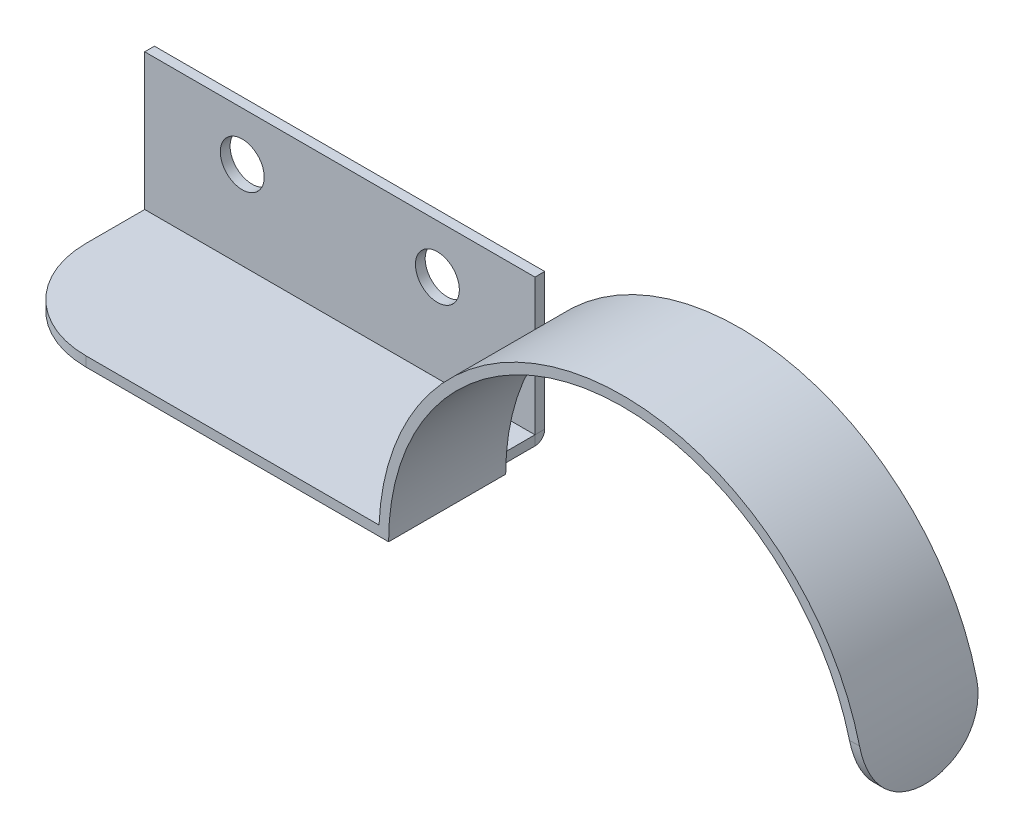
ISO-10303-21;
HEADER;
FILE_DESCRIPTION(('STEP AP214'),'2;1');
FILE_NAME('part.step','',(''),(''),'','','');
FILE_SCHEMA(('AUTOMOTIVE_DESIGN { 1 0 10303 214 1 1 1 1 }'));
ENDSEC;
DATA;
#1=APPLICATION_CONTEXT('core data for automotive mechanical design processes');
#2=APPLICATION_PROTOCOL_DEFINITION('international standard','automotive_design',2000,#1);
#3=PRODUCT_CONTEXT('',#1,'mechanical');
#4=PRODUCT('Part','Part','',(#3));
#5=PRODUCT_RELATED_PRODUCT_CATEGORY('part','',(#4));
#6=PRODUCT_DEFINITION_FORMATION('','',#4);
#7=PRODUCT_DEFINITION_CONTEXT('part definition',#1,'design');
#8=PRODUCT_DEFINITION('design','',#6,#7);
#9=PRODUCT_DEFINITION_SHAPE('','',#8);
#10=(LENGTH_UNIT() NAMED_UNIT(*) SI_UNIT(.MILLI.,.METRE.));
#11=(NAMED_UNIT(*) PLANE_ANGLE_UNIT() SI_UNIT($,.RADIAN.));
#12=(NAMED_UNIT(*) SI_UNIT($,.STERADIAN.) SOLID_ANGLE_UNIT());
#13=UNCERTAINTY_MEASURE_WITH_UNIT(LENGTH_MEASURE(1.E-05),#10,'distance_accuracy_value','');
#14=(GEOMETRIC_REPRESENTATION_CONTEXT(3) GLOBAL_UNCERTAINTY_ASSIGNED_CONTEXT((#13)) GLOBAL_UNIT_ASSIGNED_CONTEXT((#10,
#11,#12)) REPRESENTATION_CONTEXT('',''));
#15=CARTESIAN_POINT('',(0.,0.,0.));
#16=DIRECTION('',(0.,0.,1.));
#17=DIRECTION('',(1.,0.,0.));
#18=AXIS2_PLACEMENT_3D('',#15,#16,#17);
#19=CARTESIAN_POINT('',(65.,14.9999000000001,4.99992721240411));
#20=DIRECTION('',(0.,0.,1.));
#21=DIRECTION('',(1.,0.,0.));
#22=AXIS2_PLACEMENT_3D('',#19,#20,#21);
#23=CYLINDRICAL_SURFACE('',#22,25.);
#24=CARTESIAN_POINT('',(89.2693221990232,20.9999000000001,16.9999272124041));
#25=CARTESIAN_POINT('',(89.3097277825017,20.836531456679,16.9999462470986));
#26=CARTESIAN_POINT('',(89.3484559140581,20.6727348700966,16.9932552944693));
#27=CARTESIAN_POINT('',(89.4223916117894,20.3454330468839,16.9663816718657));
#28=CARTESIAN_POINT('',(89.4575987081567,20.1819278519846,16.946197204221));
#29=CARTESIAN_POINT('',(89.5243068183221,19.8564443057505,16.8922720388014));
#30=CARTESIAN_POINT('',(89.5558088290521,19.6944655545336,16.8585349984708));
#31=CARTESIAN_POINT('',(89.615051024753,19.3732196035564,16.7775861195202));
#32=CARTESIAN_POINT('',(89.6427914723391,19.2139522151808,16.7303752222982));
#33=CARTESIAN_POINT('',(89.6945610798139,18.899148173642,16.6226094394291));
#34=CARTESIAN_POINT('',(89.7185855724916,18.7436164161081,16.5620380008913));
#35=CARTESIAN_POINT('',(89.7629915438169,18.4376546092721,16.4278927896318));
#36=CARTESIAN_POINT('',(89.7833716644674,18.2872264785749,16.3543141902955));
#37=CARTESIAN_POINT('',(89.8206410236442,17.9928541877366,16.1947018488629));
#38=CARTESIAN_POINT('',(89.8375333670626,17.8489043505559,16.1086793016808));
#39=CARTESIAN_POINT('',(89.8681034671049,17.5684289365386,15.9246756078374));
#40=CARTESIAN_POINT('',(89.8817801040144,17.4319059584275,15.8266903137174));
#41=CARTESIAN_POINT('',(89.906031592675,17.1693949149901,15.621032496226));
#42=CARTESIAN_POINT('',(89.9166500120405,17.0432792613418,15.5135278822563));
#43=CARTESIAN_POINT('',(89.935386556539,16.8002754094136,15.2883525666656));
#44=CARTESIAN_POINT('',(89.9435046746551,16.6833872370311,15.1706818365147));
#45=CARTESIAN_POINT('',(89.957599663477,16.4596254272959,14.9259199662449));
#46=CARTESIAN_POINT('',(89.9635751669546,16.3527582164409,14.7988228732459));
#47=CARTESIAN_POINT('',(89.973741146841,16.1499279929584,14.5362090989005));
#48=CARTESIAN_POINT('',(89.9779322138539,16.0539613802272,14.4006952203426));
#49=CARTESIAN_POINT('',(89.98491564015,15.8729698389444,14.1212229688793));
#50=CARTESIAN_POINT('',(89.9876984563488,15.7880223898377,13.9772141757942));
#51=CARTESIAN_POINT('',(89.9921708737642,15.6304607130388,13.6826519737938));
#52=CARTESIAN_POINT('',(89.9938608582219,15.5578421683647,13.5321008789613));
#53=CARTESIAN_POINT('',(89.9964654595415,15.425459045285,13.2255633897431));
#54=CARTESIAN_POINT('',(89.9973806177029,15.3656855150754,13.0695808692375));
#55=CARTESIAN_POINT('',(89.9987099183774,15.2593593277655,12.7532233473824));
#56=CARTESIAN_POINT('',(89.9991241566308,15.212804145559,12.5928491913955));
#57=CARTESIAN_POINT('',(89.9997995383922,15.1156006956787,12.1969810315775));
#58=CARTESIAN_POINT('',(89.9999117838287,15.0722601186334,11.9596543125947));
#59=CARTESIAN_POINT('',(90.0000127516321,15.0144109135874,11.4815044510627));
#60=CARTESIAN_POINT('',(90.0000014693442,14.9999033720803,11.2406811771));
#61=CARTESIAN_POINT('',(89.9999989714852,14.9998976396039,10.8314037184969));
#62=CARTESIAN_POINT('',(90.0000027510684,15.0070019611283,10.6629141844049));
#63=CARTESIAN_POINT('',(89.9999791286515,15.035366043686,10.3270788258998));
#64=CARTESIAN_POINT('',(89.9999517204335,15.0566286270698,10.1597332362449));
#65=CARTESIAN_POINT('',(89.9997592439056,15.1131815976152,9.82732663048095));
#66=CARTESIAN_POINT('',(89.9995940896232,15.1484807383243,9.66226710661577));
#67=CARTESIAN_POINT('',(89.9989500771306,15.232870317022,9.33564725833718));
#68=CARTESIAN_POINT('',(89.998471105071,15.2819657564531,9.17408822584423));
#69=CARTESIAN_POINT('',(89.9969626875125,15.3935560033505,8.85578857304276));
#70=CARTESIAN_POINT('',(89.995933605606,15.4560419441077,8.69904484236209));
#71=CARTESIAN_POINT('',(89.993034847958,15.5940118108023,8.39132313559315));
#72=CARTESIAN_POINT('',(89.9911648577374,15.6695005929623,8.24034733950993));
#73=CARTESIAN_POINT('',(89.9862528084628,15.8328716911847,7.94538536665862));
#74=CARTESIAN_POINT('',(89.9832113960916,15.9207471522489,7.80139538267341));
#75=CARTESIAN_POINT('',(89.9755920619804,16.1083278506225,7.52128576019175));
#76=CARTESIAN_POINT('',(89.9710134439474,16.2080384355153,7.38516972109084));
#77=CARTESIAN_POINT('',(89.9599531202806,16.4182759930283,7.12217054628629));
#78=CARTESIAN_POINT('',(89.9534759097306,16.5287770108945,6.99526647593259));
#79=CARTESIAN_POINT('',(89.9382387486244,16.7599146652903,6.75131031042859));
#80=CARTESIAN_POINT('',(89.9294798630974,16.8805465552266,6.63425365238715));
#81=CARTESIAN_POINT('',(89.9093101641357,17.1311119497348,6.41073642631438));
#82=CARTESIAN_POINT('',(89.8978986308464,17.2610479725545,6.30427874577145));
#83=CARTESIAN_POINT('',(89.8720940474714,17.5291412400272,6.10279129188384));
#84=CARTESIAN_POINT('',(89.8577021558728,17.6672952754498,6.00775710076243));
#85=CARTESIAN_POINT('',(89.8257949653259,17.9494536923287,5.83056879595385));
#86=CARTESIAN_POINT('',(89.8083104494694,18.0933904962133,5.74830151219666));
#87=CARTESIAN_POINT('',(89.7699100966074,18.3871538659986,5.59614033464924));
#88=CARTESIAN_POINT('',(89.7489955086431,18.536978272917,5.52624195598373));
#89=CARTESIAN_POINT('',(89.7035674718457,18.841440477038,5.3991898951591));
#90=CARTESIAN_POINT('',(89.6790535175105,18.9960789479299,5.34203800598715));
#91=CARTESIAN_POINT('',(89.6263619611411,19.3089004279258,5.24079839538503));
#92=CARTESIAN_POINT('',(89.5981850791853,19.4670827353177,5.19670811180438));
#93=CARTESIAN_POINT('',(89.5255158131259,19.8529407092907,5.10598913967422));
#94=CARTESIAN_POINT('',(89.4791420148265,20.081894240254,5.06607510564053));
#95=CARTESIAN_POINT('',(89.4043040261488,20.4261120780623,5.0263083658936));
#96=CARTESIAN_POINT('',(89.3784977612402,20.5409045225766,5.0164034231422));
#97=CARTESIAN_POINT('',(89.3251762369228,20.7704886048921,5.00321327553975));
#98=CARTESIAN_POINT('',(89.2976607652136,20.8852802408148,4.99992889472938));
#99=CARTESIAN_POINT('',(89.2693221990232,20.9999000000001,4.99992721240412));
#100=B_SPLINE_CURVE_WITH_KNOTS('',3,(#24,#25,#26,#27,#28,#29,#30,#31,#32,#33,#34,#35,#36,#37,
#38,#39,#40,#41,#42,#43,#44,#45,#46,#47,#48,#49,#50,#51,#52,#53,#54,#55,#56,#57,#58,#59,#60,#61,
#62,#63,#64,#65,#66,#67,#68,#69,#70,#71,#72,#73,#74,#75,#76,#77,#78,#79,#80,#81,#82,#83,#84,#85,
#86,#87,#88,#89,#90,#91,#92,#93,#94,#95,#96,#97,#98,#99),.UNSPECIFIED.,.F.,.F.,(4,2,2,2,2,2,2,2,
2,2,2,2,2,2,2,2,2,2,2,2,2,2,2,2,2,2,2,2,2,2,2,2,2,2,2,2,2,4),(0.,0.504750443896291,
1.00956814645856,1.51424970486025,2.01889601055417,2.5241710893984,3.02963405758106,
3.53464509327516,4.03983171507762,4.53741836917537,5.03500641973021,5.5329114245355,
6.03065150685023,6.53172083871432,7.03261435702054,7.53315765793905,8.03360527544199,
8.75554256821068,9.47750706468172,9.98286937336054,10.4883324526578,10.9941112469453,
11.5000736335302,12.0057020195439,12.5115196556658,13.0170584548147,13.5228265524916,
14.0274067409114,14.5317518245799,15.0362339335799,15.5405203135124,16.0400439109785,
16.5393860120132,17.0387983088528,17.5381125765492,18.2471859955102,18.6012429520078,
18.9553439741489),.UNSPECIFIED.);
#101=CARTESIAN_POINT('',(89.2693221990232,20.9999000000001,16.9999272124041));
#102=VERTEX_POINT('',#101);
#103=CARTESIAN_POINT('',(89.2693221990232,20.9999000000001,4.99992721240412));
#104=VERTEX_POINT('',#103);
#105=EDGE_CURVE('E171',#102,#104,#100,.T.);
#106=ORIENTED_EDGE('',*,*,#105,.T.);
#107=CARTESIAN_POINT('',(65.,14.9999000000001,4.99992721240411));
#108=DIRECTION('',(0.,0.,1.));
#109=DIRECTION('',(1.,0.,0.));
#110=AXIS2_PLACEMENT_3D('',#107,#108,#109);
#111=CIRCLE('',#110,25.);
#112=CARTESIAN_POINT('',(40.0200080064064,15.9999000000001,4.99992721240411));
#113=VERTEX_POINT('',#112);
#114=EDGE_CURVE('E155',#104,#113,#111,.T.);
#115=ORIENTED_EDGE('',*,*,#114,.T.);
#116=DIRECTION('',(0.,0.,1.));
#117=VECTOR('',#116,1.);
#118=CARTESIAN_POINT('',(40.0200080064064,15.9999000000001,4.99992721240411));
#119=LINE('',#118,#117);
#120=CARTESIAN_POINT('',(40.0200080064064,15.9999000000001,16.9999272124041));
#121=VERTEX_POINT('',#120);
#122=EDGE_CURVE('E173',#113,#121,#119,.T.);
#123=ORIENTED_EDGE('',*,*,#122,.T.);
#124=CARTESIAN_POINT('',(65.,14.9999000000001,16.9999272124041));
#125=DIRECTION('',(0.,0.,1.));
#126=DIRECTION('',(1.,0.,0.));
#127=AXIS2_PLACEMENT_3D('',#124,#125,#126);
#128=CIRCLE('',#127,25.);
#129=EDGE_CURVE('E170',#102,#121,#128,.T.);
#130=ORIENTED_EDGE('',*,*,#129,.F.);
#131=EDGE_LOOP('',(#106,#115,#123,#130));
#132=FACE_BOUND('',#131,.T.);
#133=ADVANCED_FACE('F48',(#132),#23,.T.);
#134=CARTESIAN_POINT('',(65.,14.9999000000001,4.99992721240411));
#135=DIRECTION('',(0.,0.,1.));
#136=DIRECTION('',(1.,0.,0.));
#137=AXIS2_PLACEMENT_3D('',#134,#135,#136);
#138=CYLINDRICAL_SURFACE('',#137,24.);
#139=CARTESIAN_POINT('',(65.,14.9999000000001,4.99992721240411));
#140=DIRECTION('',(0.,0.,-1.));
#141=DIRECTION('',(1.,0.,0.));
#142=AXIS2_PLACEMENT_3D('',#139,#140,#141);
#143=CIRCLE('',#142,24.);
#144=CARTESIAN_POINT('',(41.,14.9999000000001,4.99992721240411));
#145=VERTEX_POINT('',#144);
#146=CARTESIAN_POINT('',(88.2379000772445,20.9999000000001,4.99992721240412));
#147=VERTEX_POINT('',#146);
#148=EDGE_CURVE('E152',#145,#147,#143,.T.);
#149=ORIENTED_EDGE('',*,*,#148,.T.);
#150=CARTESIAN_POINT('',(88.2379000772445,20.9999000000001,4.99992721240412));
#151=CARTESIAN_POINT('',(88.2799795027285,20.8369941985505,4.99990813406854));
#152=CARTESIAN_POINT('',(88.3203173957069,20.6736241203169,5.00656141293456));
#153=CARTESIAN_POINT('',(88.3973374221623,20.3470981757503,5.03330108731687));
#154=CARTESIAN_POINT('',(88.4340190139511,20.1839423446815,5.05338946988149));
#155=CARTESIAN_POINT('',(88.5035331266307,19.8590742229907,5.10708158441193));
#156=CARTESIAN_POINT('',(88.5363665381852,19.6973616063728,5.14068218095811));
#157=CARTESIAN_POINT('',(88.5981223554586,19.3765750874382,5.2213320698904));
#158=CARTESIAN_POINT('',(88.6270450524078,19.2175009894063,5.26838036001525));
#159=CARTESIAN_POINT('',(88.6810319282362,18.9030041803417,5.37581152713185));
#160=CARTESIAN_POINT('',(88.7060909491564,18.7475865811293,5.43621197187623));
#161=CARTESIAN_POINT('',(88.7524163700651,18.4417949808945,5.57001364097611));
#162=CARTESIAN_POINT('',(88.7736813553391,18.2914228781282,5.64341969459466));
#163=CARTESIAN_POINT('',(88.8125776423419,17.997093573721,5.80270362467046));
#164=CARTESIAN_POINT('',(88.8302116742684,17.8531316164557,5.88857204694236));
#165=CARTESIAN_POINT('',(88.862123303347,17.5726415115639,6.07225001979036));
#166=CARTESIAN_POINT('',(88.8764008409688,17.4361134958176,6.17005978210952));
#167=CARTESIAN_POINT('',(88.9017090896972,17.1736990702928,6.37526699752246));
#168=CARTESIAN_POINT('',(88.912788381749,17.0476767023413,6.48248469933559));
#169=CARTESIAN_POINT('',(88.9323448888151,16.8048135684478,6.7070721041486));
#170=CARTESIAN_POINT('',(88.9408221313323,16.6879727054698,6.82444169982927));
#171=CARTESIAN_POINT('',(88.9555458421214,16.4642763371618,7.06857350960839));
#172=CARTESIAN_POINT('',(88.9617912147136,16.357425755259,7.19534030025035));
#173=CARTESIAN_POINT('',(88.9724239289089,16.1545483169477,7.45732696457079));
#174=CARTESIAN_POINT('',(88.9768112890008,16.0585213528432,7.5925467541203));
#175=CARTESIAN_POINT('',(88.9841275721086,15.8773426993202,7.8714684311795));
#176=CARTESIAN_POINT('',(88.987046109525,15.7922715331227,8.01522290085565));
#177=CARTESIAN_POINT('',(88.9917403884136,15.6344293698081,8.30928347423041));
#178=CARTESIAN_POINT('',(88.9935165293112,15.5616540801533,8.45958726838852));
#179=CARTESIAN_POINT('',(88.9962569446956,15.4289243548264,8.76564250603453));
#180=CARTESIAN_POINT('',(88.9972217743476,15.3689611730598,8.92139014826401));
#181=CARTESIAN_POINT('',(88.9986254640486,15.2622245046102,9.2372914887));
#182=CARTESIAN_POINT('',(88.9990644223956,15.2154485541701,9.39744435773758));
#183=CARTESIAN_POINT('',(88.9997853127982,15.1172149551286,9.79463024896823));
#184=CARTESIAN_POINT('',(88.9999055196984,15.073270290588,10.0335618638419));
#185=CARTESIAN_POINT('',(89.000013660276,15.0146139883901,10.5149952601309));
#186=CARTESIAN_POINT('',(89.0000015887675,14.9999034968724,10.7574971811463));
#187=CARTESIAN_POINT('',(88.9999988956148,14.9998975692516,11.1684453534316));
#188=CARTESIAN_POINT('',(89.000002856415,15.0070014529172,11.3369287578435));
#189=CARTESIAN_POINT('',(88.9999782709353,15.0353635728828,11.6727518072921));
#190=CARTESIAN_POINT('',(88.9999497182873,15.056624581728,11.8400912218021));
#191=CARTESIAN_POINT('',(88.9997492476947,15.1131729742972,12.1724833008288));
#192=CARTESIAN_POINT('',(88.9995772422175,15.148468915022,12.3375345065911));
#193=CARTESIAN_POINT('',(88.998906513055,15.232850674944,12.6641381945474));
#194=CARTESIAN_POINT('',(88.9984076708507,15.2819414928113,12.8256893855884));
#195=CARTESIAN_POINT('',(88.9968366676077,15.3935218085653,13.1439759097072));
#196=CARTESIAN_POINT('',(88.9957648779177,15.4560026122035,13.3007142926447));
#197=CARTESIAN_POINT('',(88.9927457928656,15.5939609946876,13.6084255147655));
#198=CARTESIAN_POINT('',(88.99079816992,15.6694434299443,13.7593961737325));
#199=CARTESIAN_POINT('',(88.9856821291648,15.8328006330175,14.054348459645));
#200=CARTESIAN_POINT('',(88.9825143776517,15.9206686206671,14.1983338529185));
#201=CARTESIAN_POINT('',(88.9745784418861,16.1082317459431,14.478433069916));
#202=CARTESIAN_POINT('',(88.9698095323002,16.2079322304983,14.6145432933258));
#203=CARTESIAN_POINT('',(88.9582905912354,16.4181234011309,14.8775015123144));
#204=CARTESIAN_POINT('',(88.9515456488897,16.5285858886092,15.0043722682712));
#205=CARTESIAN_POINT('',(88.9356790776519,16.7596344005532,15.2482622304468));
#206=CARTESIAN_POINT('',(88.9265585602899,16.8802156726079,15.3652860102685));
#207=CARTESIAN_POINT('',(88.905556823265,17.1306612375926,15.5887354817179));
#208=CARTESIAN_POINT('',(88.8936749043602,17.2605278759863,15.6951584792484));
#209=CARTESIAN_POINT('',(88.8668075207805,17.5284597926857,15.8965771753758));
#210=CARTESIAN_POINT('',(88.8518232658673,17.6665218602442,15.9915773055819));
#211=CARTESIAN_POINT('',(88.8186181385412,17.9483488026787,16.1686255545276));
#212=CARTESIAN_POINT('',(88.8004321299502,18.0920404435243,16.2507968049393));
#213=CARTESIAN_POINT('',(88.7604960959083,18.3852672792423,16.4027930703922));
#214=CARTESIAN_POINT('',(88.7387473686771,18.5348003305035,16.472622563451));
#215=CARTESIAN_POINT('',(88.6915123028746,18.8386329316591,16.5995726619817));
#216=CARTESIAN_POINT('',(88.666025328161,18.9929332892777,16.6566911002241));
#217=CARTESIAN_POINT('',(88.6112482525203,19.3050232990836,16.7579062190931));
#218=CARTESIAN_POINT('',(88.5819588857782,19.4628122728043,16.8020054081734));
#219=CARTESIAN_POINT('',(88.5061373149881,19.8491272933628,16.8931591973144));
#220=CARTESIAN_POINT('',(88.4576014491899,20.0789347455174,16.9333520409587));
#221=CARTESIAN_POINT('',(88.3792521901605,20.4243402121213,16.9733834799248));
#222=CARTESIAN_POINT('',(88.3522318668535,20.5395121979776,16.9833510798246));
#223=CARTESIAN_POINT('',(88.2963960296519,20.7698198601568,16.9966224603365));
#224=CARTESIAN_POINT('',(88.2675803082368,20.8849555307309,16.9999254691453));
#225=CARTESIAN_POINT('',(88.2379000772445,20.9999000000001,16.9999272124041));
#226=B_SPLINE_CURVE_WITH_KNOTS('',3,(#150,#151,#152,#153,#154,#155,#156,#157,#158,#159,#160,
#161,#162,#163,#164,#165,#166,#167,#168,#169,#170,#171,#172,#173,#174,#175,#176,#177,#178,#179,
#180,#181,#182,#183,#184,#185,#186,#187,#188,#189,#190,#191,#192,#193,#194,#195,#196,#197,#198,
#199,#200,#201,#202,#203,#204,#205,#206,#207,#208,#209,#210,#211,#212,#213,#214,#215,#216,#217,
#218,#219,#220,#221,#222,#223,#224,#225),.UNSPECIFIED.,.F.,.F.,(4,2,2,2,2,2,2,2,2,2,2,2,2,2,2,2,
2,2,2,2,2,2,2,2,2,2,2,2,2,2,2,2,2,2,2,2,2,4),(0.,0.504637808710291,1.00935026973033,
1.51394568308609,2.01850349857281,2.52372916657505,3.02914283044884,3.53417506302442,
4.03921625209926,4.53612484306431,5.03302818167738,5.53017512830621,6.02731712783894,
6.52792654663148,7.028360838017,7.52845241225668,8.02845049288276,8.75541069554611,
9.48239939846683,9.98774431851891,10.4931882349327,10.9989407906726,11.5048768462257,
12.0104853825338,12.516283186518,13.0218051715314,13.5275564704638,14.0320165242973,
14.5362409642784,15.0405932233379,15.5447491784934,16.0437212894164,16.5425119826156,
17.0413876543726,17.5401671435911,18.2531169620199,18.6091060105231,18.9651362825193),.UNSPECIFIED.);
#227=CARTESIAN_POINT('',(88.2379000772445,20.9999000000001,16.9999272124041));
#228=VERTEX_POINT('',#227);
#229=EDGE_CURVE('E56',#147,#228,#226,.T.);
#230=ORIENTED_EDGE('',*,*,#229,.T.);
#231=CARTESIAN_POINT('',(65.,14.9999000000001,16.9999272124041));
#232=DIRECTION('',(0.,0.,-1.));
#233=DIRECTION('',(1.,0.,0.));
#234=AXIS2_PLACEMENT_3D('',#231,#232,#233);
#235=CIRCLE('',#234,24.);
#236=CARTESIAN_POINT('',(41.,14.9999000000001,16.9999272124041));
#237=VERTEX_POINT('',#236);
#238=EDGE_CURVE('E168',#237,#228,#235,.T.);
#239=ORIENTED_EDGE('',*,*,#238,.F.);
#240=DIRECTION('',(0.,0.,1.));
#241=VECTOR('',#240,1.);
#242=CARTESIAN_POINT('',(41.,14.9999000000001,4.99992721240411));
#243=LINE('',#242,#241);
#244=EDGE_CURVE('E158',#145,#237,#243,.T.);
#245=ORIENTED_EDGE('',*,*,#244,.F.);
#246=EDGE_LOOP('',(#149,#230,#239,#245));
#247=FACE_BOUND('',#246,.T.);
#248=ADVANCED_FACE('F156',(#247),#138,.F.);
#249=CARTESIAN_POINT('',(65.,14.9999000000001,4.99992721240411));
#250=DIRECTION('',(0.,0.,1.));
#251=DIRECTION('',(1.,0.,0.));
#252=AXIS2_PLACEMENT_3D('',#249,#250,#251);
#253=PLANE('',#252);
#254=DIRECTION('',(1.,0.,0.));
#255=VECTOR('',#254,1.);
#256=CARTESIAN_POINT('',(78.,20.9999000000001,4.99992721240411));
#257=LINE('',#256,#255);
#258=EDGE_CURVE('E14',#147,#104,#257,.T.);
#259=ORIENTED_EDGE('',*,*,#258,.F.);
#260=ORIENTED_EDGE('',*,*,#148,.F.);
#261=DIRECTION('',(1.,0.,0.));
#262=VECTOR('',#261,1.);
#263=CARTESIAN_POINT('',(40.,14.9999000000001,4.99992721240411));
#264=LINE('',#263,#262);
#265=CARTESIAN_POINT('',(40.,14.9999,4.99992721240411));
#266=VERTEX_POINT('',#265);
#267=EDGE_CURVE('E159',#266,#145,#264,.T.);
#268=ORIENTED_EDGE('',*,*,#267,.F.);
#269=DIRECTION('',(0.,-1.,0.));
#270=VECTOR('',#269,1.);
#271=CARTESIAN_POINT('',(40.,15.9999000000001,4.99992721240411));
#272=LINE('',#271,#270);
#273=CARTESIAN_POINT('',(40.,15.9999,4.99992721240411));
#274=VERTEX_POINT('',#273);
#275=EDGE_CURVE('E71',#274,#266,#272,.T.);
#276=ORIENTED_EDGE('',*,*,#275,.F.);
#277=DIRECTION('',(-1.,0.,0.));
#278=VECTOR('',#277,1.);
#279=CARTESIAN_POINT('',(40.,15.9999000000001,4.99992721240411));
#280=LINE('',#279,#278);
#281=EDGE_CURVE('E161',#113,#274,#280,.T.);
#282=ORIENTED_EDGE('',*,*,#281,.F.);
#283=ORIENTED_EDGE('',*,*,#114,.F.);
#284=EDGE_LOOP('',(#259,#260,#268,#276,#282,#283));
#285=FACE_BOUND('',#284,.T.);
#286=ADVANCED_FACE('F150',(#285),#253,.F.);
#287=CARTESIAN_POINT('',(40.,15.9999000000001,16.9999272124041));
#288=DIRECTION('',(-1.,0.,0.));
#289=DIRECTION('',(0.,1.,0.));
#290=AXIS2_PLACEMENT_3D('',#287,#288,#289);
#291=PLANE('',#290);
#292=ORIENTED_EDGE('',*,*,#275,.T.);
#293=DIRECTION('',(0.,0.,-1.));
#294=VECTOR('',#293,1.);
#295=CARTESIAN_POINT('',(40.,14.9999000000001,16.9999272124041));
#296=LINE('',#295,#294);
#297=CARTESIAN_POINT('',(40.,14.9999,1.0001));
#298=VERTEX_POINT('',#297);
#299=EDGE_CURVE('E193',#266,#298,#296,.T.);
#300=ORIENTED_EDGE('',*,*,#299,.T.);
#301=DIRECTION('',(0.,-1.,0.));
#302=VECTOR('',#301,1.);
#303=CARTESIAN_POINT('',(40.,15.9999000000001,1.0001));
#304=LINE('',#303,#302);
#305=CARTESIAN_POINT('',(40.,15.9999,1.0001));
#306=VERTEX_POINT('',#305);
#307=EDGE_CURVE('E254',#306,#298,#304,.T.);
#308=ORIENTED_EDGE('',*,*,#307,.F.);
#309=DIRECTION('',(0.,0.,-1.));
#310=VECTOR('',#309,1.);
#311=CARTESIAN_POINT('',(40.,15.9999000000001,16.9999272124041));
#312=LINE('',#311,#310);
#313=EDGE_CURVE('E245',#274,#306,#312,.T.);
#314=ORIENTED_EDGE('',*,*,#313,.F.);
#315=EDGE_LOOP('',(#292,#300,#308,#314));
#316=FACE_BOUND('',#315,.T.);
#317=ADVANCED_FACE('F330',(#316),#291,.F.);
#318=CARTESIAN_POINT('',(10.,14.9999,6.99992721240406));
#319=DIRECTION('',(0.,-1.,0.));
#320=DIRECTION('',(-1.,0.,0.));
#321=AXIS2_PLACEMENT_3D('',#318,#319,#320);
#322=PLANE('',#321);
#323=DIRECTION('',(0.,0.,1.));
#324=VECTOR('',#323,1.);
#325=CARTESIAN_POINT('',(0.,14.9999,6.99992721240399));
#326=LINE('',#325,#324);
#327=CARTESIAN_POINT('',(0.,14.9999,1.00010000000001));
#328=VERTEX_POINT('',#327);
#329=CARTESIAN_POINT('',(0.,14.9999,6.99992721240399));
#330=VERTEX_POINT('',#329);
#331=EDGE_CURVE('E243',#328,#330,#326,.T.);
#332=ORIENTED_EDGE('',*,*,#331,.F.);
#333=DIRECTION('',(1.,0.,0.));
#334=VECTOR('',#333,1.);
#335=CARTESIAN_POINT('',(10.,14.9999,1.0001));
#336=LINE('',#335,#334);
#337=EDGE_CURVE('E257',#328,#298,#336,.T.);
#338=ORIENTED_EDGE('',*,*,#337,.T.);
#339=ORIENTED_EDGE('',*,*,#299,.F.);
#340=ORIENTED_EDGE('',*,*,#267,.T.);
#341=ORIENTED_EDGE('',*,*,#244,.T.);
#342=DIRECTION('',(1.,0.,0.));
#343=VECTOR('',#342,1.);
#344=CARTESIAN_POINT('',(10.0000000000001,14.9999000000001,16.9999272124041));
#345=LINE('',#344,#343);
#346=CARTESIAN_POINT('',(10.0000000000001,14.9999000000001,16.9999272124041));
#347=VERTEX_POINT('',#346);
#348=EDGE_CURVE('E242',#347,#237,#345,.T.);
#349=ORIENTED_EDGE('',*,*,#348,.F.);
#350=CARTESIAN_POINT('',(10.,14.9999,6.99992721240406));
#351=DIRECTION('',(0.,1.,0.));
#352=DIRECTION('',(-1.,0.,0.));
#353=AXIS2_PLACEMENT_3D('',#350,#351,#352);
#354=CIRCLE('',#353,10.);
#355=EDGE_CURVE('E240',#330,#347,#354,.T.);
#356=ORIENTED_EDGE('',*,*,#355,.F.);
#357=EDGE_LOOP('',(#332,#338,#339,#340,#341,#349,#356));
#358=FACE_BOUND('',#357,.T.);
#359=ADVANCED_FACE('F298',(#358),#322,.T.);
#360=CARTESIAN_POINT('',(10.,15.9999,6.99992721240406));
#361=DIRECTION('',(0.,-1.,0.));
#362=DIRECTION('',(-1.,0.,0.));
#363=AXIS2_PLACEMENT_3D('',#360,#361,#362);
#364=PLANE('',#363);
#365=DIRECTION('',(1.,0.,0.));
#366=VECTOR('',#365,1.);
#367=CARTESIAN_POINT('',(10.,15.9999,1.0001));
#368=LINE('',#367,#366);
#369=CARTESIAN_POINT('',(0.,15.9999,1.0001));
#370=VERTEX_POINT('',#369);
#371=EDGE_CURVE('E251',#370,#306,#368,.T.);
#372=ORIENTED_EDGE('',*,*,#371,.F.);
#373=DIRECTION('',(0.,0.,1.));
#374=VECTOR('',#373,1.);
#375=CARTESIAN_POINT('',(0.,15.9999,6.99992721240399));
#376=LINE('',#375,#374);
#377=CARTESIAN_POINT('',(0.,15.9999,6.99992721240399));
#378=VERTEX_POINT('',#377);
#379=EDGE_CURVE('E236',#370,#378,#376,.T.);
#380=ORIENTED_EDGE('',*,*,#379,.T.);
#381=CARTESIAN_POINT('',(10.,15.9999,6.99992721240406));
#382=DIRECTION('',(0.,1.,0.));
#383=DIRECTION('',(-1.,0.,0.));
#384=AXIS2_PLACEMENT_3D('',#381,#382,#383);
#385=CIRCLE('',#384,10.);
#386=CARTESIAN_POINT('',(10.0000000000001,15.9999000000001,16.9999272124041));
#387=VERTEX_POINT('',#386);
#388=EDGE_CURVE('E233',#378,#387,#385,.T.);
#389=ORIENTED_EDGE('',*,*,#388,.T.);
#390=DIRECTION('',(1.,0.,0.));
#391=VECTOR('',#390,1.);
#392=CARTESIAN_POINT('',(10.0000000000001,15.9999000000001,16.9999272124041));
#393=LINE('',#392,#391);
#394=EDGE_CURVE('E235',#387,#121,#393,.T.);
#395=ORIENTED_EDGE('',*,*,#394,.T.);
#396=ORIENTED_EDGE('',*,*,#122,.F.);
#397=ORIENTED_EDGE('',*,*,#281,.T.);
#398=ORIENTED_EDGE('',*,*,#313,.T.);
#399=EDGE_LOOP('',(#372,#380,#389,#395,#396,#397,#398));
#400=FACE_BOUND('',#399,.T.);
#401=ADVANCED_FACE('F300',(#400),#364,.F.);
#402=CARTESIAN_POINT('',(0.,15.9999,6.99992721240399));
#403=DIRECTION('',(1.,0.,0.));
#404=DIRECTION('',(0.,-1.,0.));
#405=AXIS2_PLACEMENT_3D('',#402,#403,#404);
#406=PLANE('',#405);
#407=DIRECTION('',(0.,1.,0.));
#408=VECTOR('',#407,1.);
#409=CARTESIAN_POINT('',(0.,15.9999,1.0001));
#410=LINE('',#409,#408);
#411=EDGE_CURVE('E147',#328,#370,#410,.T.);
#412=ORIENTED_EDGE('',*,*,#411,.F.);
#413=ORIENTED_EDGE('',*,*,#331,.T.);
#414=DIRECTION('',(0.,-1.,0.));
#415=VECTOR('',#414,1.);
#416=CARTESIAN_POINT('',(0.,15.9999,6.99992721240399));
#417=LINE('',#416,#415);
#418=EDGE_CURVE('E248',#378,#330,#417,.T.);
#419=ORIENTED_EDGE('',*,*,#418,.F.);
#420=ORIENTED_EDGE('',*,*,#379,.F.);
#421=EDGE_LOOP('',(#412,#413,#419,#420));
#422=FACE_BOUND('',#421,.T.);
#423=ADVANCED_FACE('F50',(#422),#406,.F.);
#424=CARTESIAN_POINT('',(10.,15.9999,6.99992721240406));
#425=DIRECTION('',(0.,-1.,0.));
#426=DIRECTION('',(-1.,0.,0.));
#427=AXIS2_PLACEMENT_3D('',#424,#425,#426);
#428=CYLINDRICAL_SURFACE('',#427,10.);
#429=ORIENTED_EDGE('',*,*,#355,.T.);
#430=DIRECTION('',(0.,-1.,0.));
#431=VECTOR('',#430,1.);
#432=CARTESIAN_POINT('',(10.0000000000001,15.9999000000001,16.9999272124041));
#433=LINE('',#432,#431);
#434=EDGE_CURVE('E239',#387,#347,#433,.T.);
#435=ORIENTED_EDGE('',*,*,#434,.F.);
#436=ORIENTED_EDGE('',*,*,#388,.F.);
#437=ORIENTED_EDGE('',*,*,#418,.T.);
#438=EDGE_LOOP('',(#429,#435,#436,#437));
#439=FACE_BOUND('',#438,.T.);
#440=ADVANCED_FACE('F306',(#439),#428,.T.);
#441=CARTESIAN_POINT('',(10.0000000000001,15.9999000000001,16.9999272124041));
#442=DIRECTION('',(0.,0.,-1.));
#443=DIRECTION('',(0.,1.,0.));
#444=AXIS2_PLACEMENT_3D('',#441,#442,#443);
#445=PLANE('',#444);
#446=ORIENTED_EDGE('',*,*,#238,.T.);
#447=DIRECTION('',(1.,0.,0.));
#448=VECTOR('',#447,1.);
#449=CARTESIAN_POINT('',(78.,20.9999000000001,16.9999272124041));
#450=LINE('',#449,#448);
#451=EDGE_CURVE('E63',#228,#102,#450,.T.);
#452=ORIENTED_EDGE('',*,*,#451,.T.);
#453=ORIENTED_EDGE('',*,*,#129,.T.);
#454=ORIENTED_EDGE('',*,*,#394,.F.);
#455=ORIENTED_EDGE('',*,*,#434,.T.);
#456=ORIENTED_EDGE('',*,*,#348,.T.);
#457=EDGE_LOOP('',(#446,#452,#453,#454,#455,#456));
#458=FACE_BOUND('',#457,.T.);
#459=ADVANCED_FACE('F292',(#458),#445,.F.);
#460=CARTESIAN_POINT('',(0.,30.,1.));
#461=DIRECTION('',(0.,-1.,0.));
#462=DIRECTION('',(0.,0.,-1.));
#463=AXIS2_PLACEMENT_3D('',#460,#461,#462);
#464=PLANE('',#463);
#465=DIRECTION('',(-1.,0.,0.));
#466=VECTOR('',#465,1.);
#467=CARTESIAN_POINT('',(0.,30.,0.));
#468=LINE('',#467,#466);
#469=CARTESIAN_POINT('',(40.,30.,0.));
#470=VERTEX_POINT('',#469);
#471=CARTESIAN_POINT('',(0.,30.,0.));
#472=VERTEX_POINT('',#471);
#473=EDGE_CURVE('E230',#470,#472,#468,.T.);
#474=ORIENTED_EDGE('',*,*,#473,.T.);
#475=DIRECTION('',(0.,0.,-1.));
#476=VECTOR('',#475,1.);
#477=CARTESIAN_POINT('',(0.,30.,1.));
#478=LINE('',#477,#476);
#479=CARTESIAN_POINT('',(0.,30.,1.));
#480=VERTEX_POINT('',#479);
#481=EDGE_CURVE('E190',#480,#472,#478,.T.);
#482=ORIENTED_EDGE('',*,*,#481,.F.);
#483=DIRECTION('',(-1.,0.,0.));
#484=VECTOR('',#483,1.);
#485=CARTESIAN_POINT('',(0.,30.,1.));
#486=LINE('',#485,#484);
#487=CARTESIAN_POINT('',(40.,30.,1.));
#488=VERTEX_POINT('',#487);
#489=EDGE_CURVE('E211',#488,#480,#486,.T.);
#490=ORIENTED_EDGE('',*,*,#489,.F.);
#491=DIRECTION('',(0.,0.,-1.));
#492=VECTOR('',#491,1.);
#493=CARTESIAN_POINT('',(40.,30.,1.));
#494=LINE('',#493,#492);
#495=EDGE_CURVE('E227',#488,#470,#494,.T.);
#496=ORIENTED_EDGE('',*,*,#495,.T.);
#497=EDGE_LOOP('',(#474,#482,#490,#496));
#498=FACE_BOUND('',#497,.T.);
#499=ADVANCED_FACE('F339',(#498),#464,.F.);
#500=CARTESIAN_POINT('',(10.,25.,1.));
#501=DIRECTION('',(0.,0.,-1.));
#502=DIRECTION('',(-1.,0.,0.));
#503=AXIS2_PLACEMENT_3D('',#500,#501,#502);
#504=CYLINDRICAL_SURFACE('',#503,2.25);
#505=CARTESIAN_POINT('',(10.,25.,1.));
#506=DIRECTION('',(0.,0.,1.));
#507=DIRECTION('',(1.,0.,0.));
#508=AXIS2_PLACEMENT_3D('',#505,#506,#507);
#509=CIRCLE('',#508,2.25);
#510=CARTESIAN_POINT('',(12.25,25.,1.));
#511=VERTEX_POINT('',#510);
#512=EDGE_CURVE('E224',#511,#511,#509,.T.);
#513=ORIENTED_EDGE('',*,*,#512,.T.);
#514=EDGE_LOOP('',(#513));
#515=FACE_BOUND('',#514,.T.);
#516=CARTESIAN_POINT('',(10.,25.,0.));
#517=DIRECTION('',(0.,0.,1.));
#518=DIRECTION('',(1.,0.,0.));
#519=AXIS2_PLACEMENT_3D('',#516,#517,#518);
#520=CIRCLE('',#519,2.25);
#521=CARTESIAN_POINT('',(12.25,25.,0.));
#522=VERTEX_POINT('',#521);
#523=EDGE_CURVE('E203',#522,#522,#520,.T.);
#524=ORIENTED_EDGE('',*,*,#523,.F.);
#525=EDGE_LOOP('',(#524));
#526=FACE_BOUND('',#525,.T.);
#527=ADVANCED_FACE('F394',(#515,#526),#504,.F.);
#528=CARTESIAN_POINT('',(30.,25.,1.));
#529=DIRECTION('',(0.,0.,-1.));
#530=DIRECTION('',(-1.,0.,0.));
#531=AXIS2_PLACEMENT_3D('',#528,#529,#530);
#532=CYLINDRICAL_SURFACE('',#531,2.25000000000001);
#533=CARTESIAN_POINT('',(30.,25.,1.));
#534=DIRECTION('',(0.,0.,1.));
#535=DIRECTION('',(1.,0.,0.));
#536=AXIS2_PLACEMENT_3D('',#533,#534,#535);
#537=CIRCLE('',#536,2.25000000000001);
#538=CARTESIAN_POINT('',(32.25,25.,1.));
#539=VERTEX_POINT('',#538);
#540=EDGE_CURVE('E221',#539,#539,#537,.T.);
#541=ORIENTED_EDGE('',*,*,#540,.T.);
#542=EDGE_LOOP('',(#541));
#543=FACE_BOUND('',#542,.T.);
#544=CARTESIAN_POINT('',(30.,25.,0.));
#545=DIRECTION('',(0.,0.,1.));
#546=DIRECTION('',(1.,0.,0.));
#547=AXIS2_PLACEMENT_3D('',#544,#545,#546);
#548=CIRCLE('',#547,2.25000000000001);
#549=CARTESIAN_POINT('',(32.25,25.,0.));
#550=VERTEX_POINT('',#549);
#551=EDGE_CURVE('E200',#550,#550,#548,.T.);
#552=ORIENTED_EDGE('',*,*,#551,.F.);
#553=EDGE_LOOP('',(#552));
#554=FACE_BOUND('',#553,.T.);
#555=ADVANCED_FACE('F349',(#543,#554),#532,.F.);
#556=CARTESIAN_POINT('',(10.,10.,1.));
#557=DIRECTION('',(0.,0.,-1.));
#558=DIRECTION('',(-1.,0.,0.));
#559=AXIS2_PLACEMENT_3D('',#556,#557,#558);
#560=PLANE('',#559);
#561=ORIENTED_EDGE('',*,*,#540,.F.);
#562=EDGE_LOOP('',(#561));
#563=FACE_BOUND('',#562,.T.);
#564=ORIENTED_EDGE('',*,*,#512,.F.);
#565=EDGE_LOOP('',(#564));
#566=FACE_BOUND('',#565,.T.);
#567=DIRECTION('',(0.,-1.,0.));
#568=VECTOR('',#567,1.);
#569=CARTESIAN_POINT('',(0.,10.0000000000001,1.));
#570=LINE('',#569,#568);
#571=CARTESIAN_POINT('',(0.,16.,1.));
#572=VERTEX_POINT('',#571);
#573=EDGE_CURVE('E218',#480,#572,#570,.T.);
#574=ORIENTED_EDGE('',*,*,#573,.T.);
#575=DIRECTION('',(1.,0.,0.));
#576=VECTOR('',#575,1.);
#577=CARTESIAN_POINT('',(10.,16.,1.));
#578=LINE('',#577,#576);
#579=CARTESIAN_POINT('',(40.,16.,1.));
#580=VERTEX_POINT('',#579);
#581=EDGE_CURVE('E215',#572,#580,#578,.T.);
#582=ORIENTED_EDGE('',*,*,#581,.T.);
#583=DIRECTION('',(0.,1.,0.));
#584=VECTOR('',#583,1.);
#585=CARTESIAN_POINT('',(40.,0.,1.));
#586=LINE('',#585,#584);
#587=EDGE_CURVE('E213',#580,#488,#586,.T.);
#588=ORIENTED_EDGE('',*,*,#587,.T.);
#589=ORIENTED_EDGE('',*,*,#489,.T.);
#590=EDGE_LOOP('',(#574,#582,#588,#589));
#591=FACE_BOUND('',#590,.T.);
#592=ADVANCED_FACE('F335',(#563,#566,#591),#560,.F.);
#593=CARTESIAN_POINT('',(40.,0.,1.));
#594=DIRECTION('',(-1.,0.,0.));
#595=DIRECTION('',(0.,0.,1.));
#596=AXIS2_PLACEMENT_3D('',#593,#594,#595);
#597=PLANE('',#596);
#598=ORIENTED_EDGE('',*,*,#587,.F.);
#599=DIRECTION('',(0.,0.,-1.));
#600=VECTOR('',#599,1.);
#601=CARTESIAN_POINT('',(40.,16.,1.00000000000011));
#602=LINE('',#601,#600);
#603=CARTESIAN_POINT('',(40.,16.,0.));
#604=VERTEX_POINT('',#603);
#605=EDGE_CURVE('E208',#580,#604,#602,.T.);
#606=ORIENTED_EDGE('',*,*,#605,.T.);
#607=DIRECTION('',(0.,1.,0.));
#608=VECTOR('',#607,1.);
#609=CARTESIAN_POINT('',(40.,0.,0.));
#610=LINE('',#609,#608);
#611=EDGE_CURVE('E206',#604,#470,#610,.T.);
#612=ORIENTED_EDGE('',*,*,#611,.T.);
#613=ORIENTED_EDGE('',*,*,#495,.F.);
#614=EDGE_LOOP('',(#598,#606,#612,#613));
#615=FACE_BOUND('',#614,.T.);
#616=ADVANCED_FACE('F341',(#615),#597,.F.);
#617=CARTESIAN_POINT('',(10.,10.,0.));
#618=DIRECTION('',(0.,0.,-1.));
#619=DIRECTION('',(-1.,0.,0.));
#620=AXIS2_PLACEMENT_3D('',#617,#618,#619);
#621=PLANE('',#620);
#622=DIRECTION('',(1.,0.,0.));
#623=VECTOR('',#622,1.);
#624=CARTESIAN_POINT('',(10.,16.,0.));
#625=LINE('',#624,#623);
#626=CARTESIAN_POINT('',(0.,16.,0.));
#627=VERTEX_POINT('',#626);
#628=EDGE_CURVE('E185',#627,#604,#625,.T.);
#629=ORIENTED_EDGE('',*,*,#628,.F.);
#630=DIRECTION('',(0.,-1.,0.));
#631=VECTOR('',#630,1.);
#632=CARTESIAN_POINT('',(0.,10.0000000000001,0.));
#633=LINE('',#632,#631);
#634=EDGE_CURVE('E197',#472,#627,#633,.T.);
#635=ORIENTED_EDGE('',*,*,#634,.F.);
#636=ORIENTED_EDGE('',*,*,#473,.F.);
#637=ORIENTED_EDGE('',*,*,#611,.F.);
#638=EDGE_LOOP('',(#629,#635,#636,#637));
#639=FACE_BOUND('',#638,.T.);
#640=ORIENTED_EDGE('',*,*,#523,.T.);
#641=EDGE_LOOP('',(#640));
#642=FACE_BOUND('',#641,.T.);
#643=ORIENTED_EDGE('',*,*,#551,.T.);
#644=EDGE_LOOP('',(#643));
#645=FACE_BOUND('',#644,.T.);
#646=ADVANCED_FACE('F325',(#639,#642,#645),#621,.T.);
#647=CARTESIAN_POINT('',(0.,10.0000000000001,1.));
#648=DIRECTION('',(1.,0.,0.));
#649=DIRECTION('',(0.,0.,-1.));
#650=AXIS2_PLACEMENT_3D('',#647,#648,#649);
#651=PLANE('',#650);
#652=ORIENTED_EDGE('',*,*,#634,.T.);
#653=DIRECTION('',(0.,0.,1.));
#654=VECTOR('',#653,1.);
#655=CARTESIAN_POINT('',(0.,16.,1.00000000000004));
#656=LINE('',#655,#654);
#657=EDGE_CURVE('E194',#627,#572,#656,.T.);
#658=ORIENTED_EDGE('',*,*,#657,.T.);
#659=ORIENTED_EDGE('',*,*,#573,.F.);
#660=ORIENTED_EDGE('',*,*,#481,.T.);
#661=EDGE_LOOP('',(#652,#658,#659,#660));
#662=FACE_BOUND('',#661,.T.);
#663=ADVANCED_FACE('F318',(#662),#651,.F.);
#664=CARTESIAN_POINT('',(0.,16.,1.0001));
#665=DIRECTION('',(1.,0.,0.));
#666=DIRECTION('',(0.,0.,-1.));
#667=AXIS2_PLACEMENT_3D('',#664,#665,#666);
#668=PLANE('',#667);
#669=ORIENTED_EDGE('',*,*,#657,.F.);
#670=CARTESIAN_POINT('',(0.,16.,1.0001));
#671=DIRECTION('',(1.,0.,0.));
#672=DIRECTION('',(0.,0.,-1.));
#673=AXIS2_PLACEMENT_3D('',#670,#671,#672);
#674=CIRCLE('',#673,1.0001);
#675=EDGE_CURVE('E176',#627,#328,#674,.F.);
#676=ORIENTED_EDGE('',*,*,#675,.T.);
#677=ORIENTED_EDGE('',*,*,#411,.T.);
#678=CARTESIAN_POINT('',(0.,16.,1.0001));
#679=DIRECTION('',(-1.,0.,0.));
#680=DIRECTION('',(0.,0.,1.));
#681=AXIS2_PLACEMENT_3D('',#678,#679,#680);
#682=CIRCLE('',#681,9.99999999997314E-05);
#683=EDGE_CURVE('E178',#572,#370,#682,.T.);
#684=ORIENTED_EDGE('',*,*,#683,.F.);
#685=EDGE_LOOP('',(#669,#676,#677,#684));
#686=FACE_BOUND('',#685,.T.);
#687=ADVANCED_FACE('F314',(#686),#668,.F.);
#688=CARTESIAN_POINT('',(40.,16.,1.0001));
#689=DIRECTION('',(-1.,0.,0.));
#690=DIRECTION('',(0.,0.,1.));
#691=AXIS2_PLACEMENT_3D('',#688,#689,#690);
#692=PLANE('',#691);
#693=ORIENTED_EDGE('',*,*,#307,.T.);
#694=CARTESIAN_POINT('',(40.,16.,1.0001));
#695=DIRECTION('',(1.,0.,0.));
#696=DIRECTION('',(0.,0.,-1.));
#697=AXIS2_PLACEMENT_3D('',#694,#695,#696);
#698=CIRCLE('',#697,1.0001);
#699=EDGE_CURVE('E182',#298,#604,#698,.T.);
#700=ORIENTED_EDGE('',*,*,#699,.T.);
#701=ORIENTED_EDGE('',*,*,#605,.F.);
#702=CARTESIAN_POINT('',(40.,16.,1.0001));
#703=DIRECTION('',(1.,0.,0.));
#704=DIRECTION('',(0.,0.,-1.));
#705=AXIS2_PLACEMENT_3D('',#702,#703,#704);
#706=CIRCLE('',#705,9.99999999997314E-05);
#707=EDGE_CURVE('E181',#306,#580,#706,.T.);
#708=ORIENTED_EDGE('',*,*,#707,.F.);
#709=EDGE_LOOP('',(#693,#700,#701,#708));
#710=FACE_BOUND('',#709,.T.);
#711=ADVANCED_FACE('F328',(#710),#692,.F.);
#712=CARTESIAN_POINT('',(-20.0124980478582,16.,1.0001));
#713=DIRECTION('',(1.,0.,0.));
#714=DIRECTION('',(0.,0.,-1.));
#715=AXIS2_PLACEMENT_3D('',#712,#713,#714);
#716=CYLINDRICAL_SURFACE('',#715,0.0001);
#717=ORIENTED_EDGE('',*,*,#707,.T.);
#718=ORIENTED_EDGE('',*,*,#581,.F.);
#719=ORIENTED_EDGE('',*,*,#683,.T.);
#720=ORIENTED_EDGE('',*,*,#371,.T.);
#721=EDGE_LOOP('',(#717,#718,#719,#720));
#722=FACE_BOUND('',#721,.T.);
#723=ADVANCED_FACE('F332',(#722),#716,.F.);
#724=CARTESIAN_POINT('',(-20.0124980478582,16.,1.0001));
#725=DIRECTION('',(1.,0.,0.));
#726=DIRECTION('',(0.,0.,-1.));
#727=AXIS2_PLACEMENT_3D('',#724,#725,#726);
#728=CYLINDRICAL_SURFACE('',#727,1.0001);
#729=ORIENTED_EDGE('',*,*,#699,.F.);
#730=ORIENTED_EDGE('',*,*,#337,.F.);
#731=ORIENTED_EDGE('',*,*,#675,.F.);
#732=ORIENTED_EDGE('',*,*,#628,.T.);
#733=EDGE_LOOP('',(#729,#730,#731,#732));
#734=FACE_BOUND('',#733,.T.);
#735=ADVANCED_FACE('F276',(#734),#728,.T.);
#736=CARTESIAN_POINT('',(78.,20.9999000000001,10.9999272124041));
#737=DIRECTION('',(1.,0.,0.));
#738=DIRECTION('',(0.,0.,-1.));
#739=AXIS2_PLACEMENT_3D('',#736,#737,#738);
#740=CYLINDRICAL_SURFACE('',#739,6.);
#741=ORIENTED_EDGE('',*,*,#451,.F.);
#742=ORIENTED_EDGE('',*,*,#229,.F.);
#743=ORIENTED_EDGE('',*,*,#258,.T.);
#744=ORIENTED_EDGE('',*,*,#105,.F.);
#745=EDGE_LOOP('',(#741,#742,#743,#744));
#746=FACE_BOUND('',#745,.T.);
#747=ADVANCED_FACE('F141',(#746),#740,.T.);
#748=CLOSED_SHELL('',(#133,#248,#286,#317,#359,#401,#423,#440,#459,#499,#527,#555,#592,#616,
#646,#663,#687,#711,#723,#735,#747));
#749=MANIFOLD_SOLID_BREP('B2',#748);
#750=ADVANCED_BREP_SHAPE_REPRESENTATION('',(#18,#749),#14);
#751=SHAPE_DEFINITION_REPRESENTATION(#9,#750);
ENDSEC;
END-ISO-10303-21;
